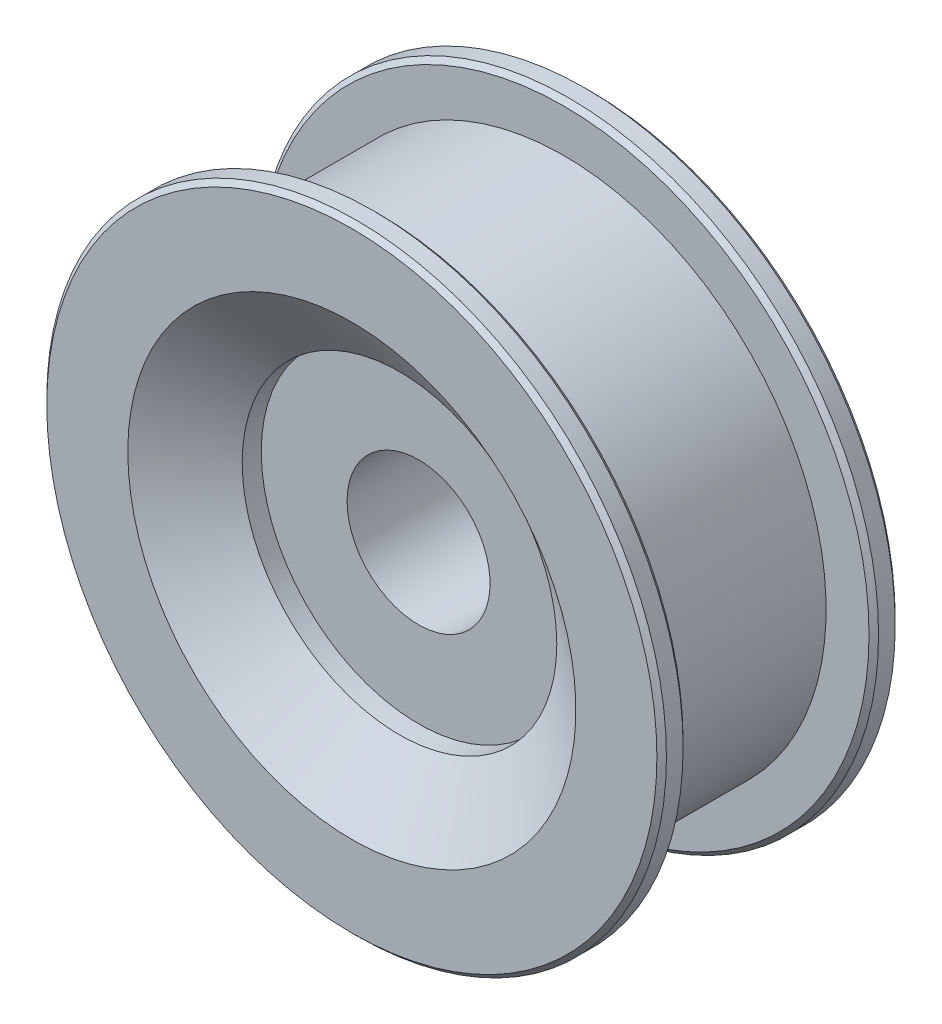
ISO-10303-21;
HEADER;
FILE_DESCRIPTION(('STEP AP214'),'2;1');
FILE_NAME('part.step','',(''),(''),'','','');
FILE_SCHEMA(('AUTOMOTIVE_DESIGN { 1 0 10303 214 1 1 1 1 }'));
ENDSEC;
DATA;
#1=APPLICATION_CONTEXT('core data for automotive mechanical design processes');
#2=APPLICATION_PROTOCOL_DEFINITION('international standard','automotive_design',2000,#1);
#3=PRODUCT_CONTEXT('',#1,'mechanical');
#4=PRODUCT('Part','Part','',(#3));
#5=PRODUCT_RELATED_PRODUCT_CATEGORY('part','',(#4));
#6=PRODUCT_DEFINITION_FORMATION('','',#4);
#7=PRODUCT_DEFINITION_CONTEXT('part definition',#1,'design');
#8=PRODUCT_DEFINITION('design','',#6,#7);
#9=PRODUCT_DEFINITION_SHAPE('','',#8);
#10=(LENGTH_UNIT() NAMED_UNIT(*) SI_UNIT(.MILLI.,.METRE.));
#11=(NAMED_UNIT(*) PLANE_ANGLE_UNIT() SI_UNIT($,.RADIAN.));
#12=(NAMED_UNIT(*) SI_UNIT($,.STERADIAN.) SOLID_ANGLE_UNIT());
#13=UNCERTAINTY_MEASURE_WITH_UNIT(LENGTH_MEASURE(1.E-05),#10,'distance_accuracy_value','');
#14=(GEOMETRIC_REPRESENTATION_CONTEXT(3) GLOBAL_UNCERTAINTY_ASSIGNED_CONTEXT((#13)) GLOBAL_UNIT_ASSIGNED_CONTEXT((#10,
#11,#12)) REPRESENTATION_CONTEXT('',''));
#15=CARTESIAN_POINT('',(0.,0.,0.));
#16=DIRECTION('',(0.,0.,1.));
#17=DIRECTION('',(1.,0.,0.));
#18=AXIS2_PLACEMENT_3D('',#15,#16,#17);
#19=CARTESIAN_POINT('',(0.,7.5,-5.5));
#20=DIRECTION('',(0.,0.,-1.));
#21=DIRECTION('',(-1.,0.,0.));
#22=AXIS2_PLACEMENT_3D('',#19,#20,#21);
#23=PLANE('',#22);
#24=CARTESIAN_POINT('',(0.,0.,-5.5));
#25=DIRECTION('',(0.,0.,-1.));
#26=DIRECTION('',(-1.,0.,0.));
#27=AXIS2_PLACEMENT_3D('',#24,#25,#26);
#28=CIRCLE('',#27,16.5);
#29=CARTESIAN_POINT('',(-16.5,0.,-5.5));
#30=VERTEX_POINT('',#29);
#31=EDGE_CURVE('E71',#30,#30,#28,.T.);
#32=ORIENTED_EDGE('',*,*,#31,.T.);
#33=EDGE_LOOP('',(#32));
#34=FACE_BOUND('',#33,.T.);
#35=CARTESIAN_POINT('',(0.,0.,-5.5));
#36=DIRECTION('',(0.,0.,-1.));
#37=DIRECTION('',(-1.,0.,0.));
#38=AXIS2_PLACEMENT_3D('',#35,#36,#37);
#39=CIRCLE('',#38,7.5);
#40=CARTESIAN_POINT('',(-7.5,0.,-5.5));
#41=VERTEX_POINT('',#40);
#42=EDGE_CURVE('E44',#41,#41,#39,.T.);
#43=ORIENTED_EDGE('',*,*,#42,.F.);
#44=EDGE_LOOP('',(#43));
#45=FACE_BOUND('',#44,.T.);
#46=ADVANCED_FACE('F12',(#34,#45),#23,.T.);
#47=CARTESIAN_POINT('',(0.,0.,-20.));
#48=DIRECTION('',(0.,0.,-1.));
#49=DIRECTION('',(-1.,0.,0.));
#50=AXIS2_PLACEMENT_3D('',#47,#48,#49);
#51=CYLINDRICAL_SURFACE('',#50,7.5);
#52=ORIENTED_EDGE('',*,*,#42,.T.);
#53=EDGE_LOOP('',(#52));
#54=FACE_BOUND('',#53,.T.);
#55=CARTESIAN_POINT('',(0.,0.,5.5));
#56=DIRECTION('',(0.,0.,-1.));
#57=DIRECTION('',(-1.,0.,0.));
#58=AXIS2_PLACEMENT_3D('',#55,#56,#57);
#59=CIRCLE('',#58,7.5);
#60=CARTESIAN_POINT('',(-7.5,0.,5.5));
#61=VERTEX_POINT('',#60);
#62=EDGE_CURVE('E47',#61,#61,#59,.T.);
#63=ORIENTED_EDGE('',*,*,#62,.F.);
#64=EDGE_LOOP('',(#63));
#65=FACE_BOUND('',#64,.T.);
#66=ADVANCED_FACE('F95',(#54,#65),#51,.F.);
#67=CARTESIAN_POINT('',(0.,7.5,5.5));
#68=DIRECTION('',(0.,0.,-1.));
#69=DIRECTION('',(-1.,0.,0.));
#70=AXIS2_PLACEMENT_3D('',#67,#68,#69);
#71=PLANE('',#70);
#72=CARTESIAN_POINT('',(0.,0.,5.5));
#73=DIRECTION('',(0.,0.,-1.));
#74=DIRECTION('',(-1.,0.,0.));
#75=AXIS2_PLACEMENT_3D('',#72,#73,#74);
#76=CIRCLE('',#75,16.5);
#77=CARTESIAN_POINT('',(-16.5,0.,5.5));
#78=VERTEX_POINT('',#77);
#79=EDGE_CURVE('E50',#78,#78,#76,.T.);
#80=ORIENTED_EDGE('',*,*,#79,.F.);
#81=EDGE_LOOP('',(#80));
#82=FACE_BOUND('',#81,.T.);
#83=ORIENTED_EDGE('',*,*,#62,.T.);
#84=EDGE_LOOP('',(#83));
#85=FACE_BOUND('',#84,.T.);
#86=ADVANCED_FACE('F100',(#82,#85),#71,.F.);
#87=CARTESIAN_POINT('',(0.,0.,-20.));
#88=DIRECTION('',(0.,0.,-1.));
#89=DIRECTION('',(-1.,0.,0.));
#90=AXIS2_PLACEMENT_3D('',#87,#88,#89);
#91=CYLINDRICAL_SURFACE('',#90,16.5);
#92=CARTESIAN_POINT('',(0.,0.,7.5));
#93=DIRECTION('',(0.,0.,-1.));
#94=DIRECTION('',(-1.,0.,0.));
#95=AXIS2_PLACEMENT_3D('',#92,#93,#94);
#96=CIRCLE('',#95,16.5);
#97=CARTESIAN_POINT('',(-16.5,0.,7.5));
#98=VERTEX_POINT('',#97);
#99=EDGE_CURVE('E53',#98,#98,#96,.T.);
#100=ORIENTED_EDGE('',*,*,#99,.F.);
#101=EDGE_LOOP('',(#100));
#102=FACE_BOUND('',#101,.T.);
#103=ORIENTED_EDGE('',*,*,#79,.T.);
#104=EDGE_LOOP('',(#103));
#105=FACE_BOUND('',#104,.T.);
#106=ADVANCED_FACE('F137',(#102,#105),#91,.F.);
#107=CARTESIAN_POINT('',(0.,0.,7.5));
#108=DIRECTION('',(0.,0.,1.));
#109=DIRECTION('',(1.,0.,0.));
#110=AXIS2_PLACEMENT_3D('',#107,#108,#109);
#111=CONICAL_SURFACE('',#110,16.5,0.950546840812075);
#112=CARTESIAN_POINT('',(0.,0.,12.5));
#113=DIRECTION('',(0.,0.,-1.));
#114=DIRECTION('',(-1.,0.,0.));
#115=AXIS2_PLACEMENT_3D('',#112,#113,#114);
#116=CIRCLE('',#115,23.5);
#117=CARTESIAN_POINT('',(-23.5,0.,12.5));
#118=VERTEX_POINT('',#117);
#119=EDGE_CURVE('E56',#118,#118,#116,.T.);
#120=ORIENTED_EDGE('',*,*,#119,.F.);
#121=EDGE_LOOP('',(#120));
#122=FACE_BOUND('',#121,.T.);
#123=ORIENTED_EDGE('',*,*,#99,.T.);
#124=EDGE_LOOP('',(#123));
#125=FACE_BOUND('',#124,.T.);
#126=ADVANCED_FACE('F131',(#122,#125),#111,.F.);
#127=CARTESIAN_POINT('',(0.,32.5,12.5));
#128=DIRECTION('',(0.,0.,1.));
#129=DIRECTION('',(1.,0.,0.));
#130=AXIS2_PLACEMENT_3D('',#127,#128,#129);
#131=PLANE('',#130);
#132=CARTESIAN_POINT('',(0.,0.,12.5));
#133=DIRECTION('',(0.,0.,1.));
#134=DIRECTION('',(1.,0.,0.));
#135=AXIS2_PLACEMENT_3D('',#132,#133,#134);
#136=CIRCLE('',#135,32.);
#137=CARTESIAN_POINT('',(32.,0.,12.5));
#138=VERTEX_POINT('',#137);
#139=EDGE_CURVE('E19',#138,#138,#136,.T.);
#140=ORIENTED_EDGE('',*,*,#139,.T.);
#141=EDGE_LOOP('',(#140));
#142=FACE_BOUND('',#141,.T.);
#143=ORIENTED_EDGE('',*,*,#119,.T.);
#144=EDGE_LOOP('',(#143));
#145=FACE_BOUND('',#144,.T.);
#146=ADVANCED_FACE('F121',(#142,#145),#131,.T.);
#147=CARTESIAN_POINT('',(0.,0.,-20.));
#148=DIRECTION('',(0.,0.,-1.));
#149=DIRECTION('',(-1.,0.,0.));
#150=AXIS2_PLACEMENT_3D('',#147,#148,#149);
#151=CYLINDRICAL_SURFACE('',#150,32.5);
#152=CARTESIAN_POINT('',(0.,0.,12.));
#153=DIRECTION('',(0.,0.,1.));
#154=DIRECTION('',(1.,0.,0.));
#155=AXIS2_PLACEMENT_3D('',#152,#153,#154);
#156=CIRCLE('',#155,32.5);
#157=CARTESIAN_POINT('',(32.5,0.,12.));
#158=VERTEX_POINT('',#157);
#159=EDGE_CURVE('E23',#158,#158,#156,.F.);
#160=ORIENTED_EDGE('',*,*,#159,.T.);
#161=EDGE_LOOP('',(#160));
#162=FACE_BOUND('',#161,.T.);
#163=CARTESIAN_POINT('',(0.,0.,10.25));
#164=DIRECTION('',(0.,0.,1.));
#165=DIRECTION('',(1.,0.,0.));
#166=AXIS2_PLACEMENT_3D('',#163,#164,#165);
#167=CIRCLE('',#166,32.5);
#168=CARTESIAN_POINT('',(32.5,0.,10.25));
#169=VERTEX_POINT('',#168);
#170=EDGE_CURVE('E27',#169,#169,#167,.T.);
#171=ORIENTED_EDGE('',*,*,#170,.T.);
#172=EDGE_LOOP('',(#171));
#173=FACE_BOUND('',#172,.T.);
#174=ADVANCED_FACE('F117',(#162,#173),#151,.T.);
#175=CARTESIAN_POINT('',(0.,32.5,9.75));
#176=DIRECTION('',(0.,0.,1.));
#177=DIRECTION('',(1.,0.,0.));
#178=AXIS2_PLACEMENT_3D('',#175,#176,#177);
#179=PLANE('',#178);
#180=CARTESIAN_POINT('',(0.,0.,9.75));
#181=DIRECTION('',(0.,0.,1.));
#182=DIRECTION('',(1.,0.,0.));
#183=AXIS2_PLACEMENT_3D('',#180,#181,#182);
#184=CIRCLE('',#183,32.);
#185=CARTESIAN_POINT('',(32.,0.,9.75));
#186=VERTEX_POINT('',#185);
#187=EDGE_CURVE('E8',#186,#186,#184,.F.);
#188=ORIENTED_EDGE('',*,*,#187,.T.);
#189=EDGE_LOOP('',(#188));
#190=FACE_BOUND('',#189,.T.);
#191=CARTESIAN_POINT('',(0.,0.,9.75));
#192=DIRECTION('',(0.,0.,-1.));
#193=DIRECTION('',(-1.,0.,0.));
#194=AXIS2_PLACEMENT_3D('',#191,#192,#193);
#195=CIRCLE('',#194,27.5);
#196=CARTESIAN_POINT('',(-27.5,0.,9.75));
#197=VERTEX_POINT('',#196);
#198=EDGE_CURVE('E59',#197,#197,#195,.T.);
#199=ORIENTED_EDGE('',*,*,#198,.F.);
#200=EDGE_LOOP('',(#199));
#201=FACE_BOUND('',#200,.T.);
#202=ADVANCED_FACE('F120',(#190,#201),#179,.F.);
#203=CARTESIAN_POINT('',(0.,0.,-20.));
#204=DIRECTION('',(0.,0.,-1.));
#205=DIRECTION('',(-1.,0.,0.));
#206=AXIS2_PLACEMENT_3D('',#203,#204,#205);
#207=CYLINDRICAL_SURFACE('',#206,27.5);
#208=ORIENTED_EDGE('',*,*,#198,.T.);
#209=EDGE_LOOP('',(#208));
#210=FACE_BOUND('',#209,.T.);
#211=CARTESIAN_POINT('',(0.,0.,-9.75));
#212=DIRECTION('',(0.,0.,-1.));
#213=DIRECTION('',(-1.,0.,0.));
#214=AXIS2_PLACEMENT_3D('',#211,#212,#213);
#215=CIRCLE('',#214,27.5);
#216=CARTESIAN_POINT('',(-27.5,0.,-9.75));
#217=VERTEX_POINT('',#216);
#218=EDGE_CURVE('E62',#217,#217,#215,.T.);
#219=ORIENTED_EDGE('',*,*,#218,.F.);
#220=EDGE_LOOP('',(#219));
#221=FACE_BOUND('',#220,.T.);
#222=ADVANCED_FACE('F129',(#210,#221),#207,.T.);
#223=CARTESIAN_POINT('',(0.,32.5,-9.75));
#224=DIRECTION('',(0.,0.,1.));
#225=DIRECTION('',(1.,0.,0.));
#226=AXIS2_PLACEMENT_3D('',#223,#224,#225);
#227=PLANE('',#226);
#228=CARTESIAN_POINT('',(0.,0.,-9.75));
#229=DIRECTION('',(0.,0.,1.));
#230=DIRECTION('',(1.,0.,0.));
#231=AXIS2_PLACEMENT_3D('',#228,#229,#230);
#232=CIRCLE('',#231,32.);
#233=CARTESIAN_POINT('',(32.,0.,-9.75));
#234=VERTEX_POINT('',#233);
#235=EDGE_CURVE('E32',#234,#234,#232,.T.);
#236=ORIENTED_EDGE('',*,*,#235,.T.);
#237=EDGE_LOOP('',(#236));
#238=FACE_BOUND('',#237,.T.);
#239=ORIENTED_EDGE('',*,*,#218,.T.);
#240=EDGE_LOOP('',(#239));
#241=FACE_BOUND('',#240,.T.);
#242=ADVANCED_FACE('F193',(#238,#241),#227,.T.);
#243=CARTESIAN_POINT('',(0.,0.,-20.));
#244=DIRECTION('',(0.,0.,-1.));
#245=DIRECTION('',(-1.,0.,0.));
#246=AXIS2_PLACEMENT_3D('',#243,#244,#245);
#247=CYLINDRICAL_SURFACE('',#246,32.5);
#248=CARTESIAN_POINT('',(0.,0.,-12.));
#249=DIRECTION('',(0.,0.,1.));
#250=DIRECTION('',(1.,0.,0.));
#251=AXIS2_PLACEMENT_3D('',#248,#249,#250);
#252=CIRCLE('',#251,32.5);
#253=CARTESIAN_POINT('',(32.5,0.,-12.));
#254=VERTEX_POINT('',#253);
#255=EDGE_CURVE('E35',#254,#254,#252,.T.);
#256=ORIENTED_EDGE('',*,*,#255,.T.);
#257=EDGE_LOOP('',(#256));
#258=FACE_BOUND('',#257,.T.);
#259=CARTESIAN_POINT('',(0.,0.,-10.25));
#260=DIRECTION('',(0.,0.,1.));
#261=DIRECTION('',(1.,0.,0.));
#262=AXIS2_PLACEMENT_3D('',#259,#260,#261);
#263=CIRCLE('',#262,32.5);
#264=CARTESIAN_POINT('',(32.5,0.,-10.25));
#265=VERTEX_POINT('',#264);
#266=EDGE_CURVE('E38',#265,#265,#263,.F.);
#267=ORIENTED_EDGE('',*,*,#266,.T.);
#268=EDGE_LOOP('',(#267));
#269=FACE_BOUND('',#268,.T.);
#270=ADVANCED_FACE('F202',(#258,#269),#247,.T.);
#271=CARTESIAN_POINT('',(0.,32.5,-12.5));
#272=DIRECTION('',(0.,0.,1.));
#273=DIRECTION('',(1.,0.,0.));
#274=AXIS2_PLACEMENT_3D('',#271,#272,#273);
#275=PLANE('',#274);
#276=CARTESIAN_POINT('',(0.,0.,-12.5));
#277=DIRECTION('',(0.,0.,1.));
#278=DIRECTION('',(1.,0.,0.));
#279=AXIS2_PLACEMENT_3D('',#276,#277,#278);
#280=CIRCLE('',#279,32.);
#281=CARTESIAN_POINT('',(32.,0.,-12.5));
#282=VERTEX_POINT('',#281);
#283=EDGE_CURVE('E41',#282,#282,#280,.F.);
#284=ORIENTED_EDGE('',*,*,#283,.T.);
#285=EDGE_LOOP('',(#284));
#286=FACE_BOUND('',#285,.T.);
#287=CARTESIAN_POINT('',(0.,0.,-12.5));
#288=DIRECTION('',(0.,0.,-1.));
#289=DIRECTION('',(-1.,0.,0.));
#290=AXIS2_PLACEMENT_3D('',#287,#288,#289);
#291=CIRCLE('',#290,23.5);
#292=CARTESIAN_POINT('',(-23.5,0.,-12.5));
#293=VERTEX_POINT('',#292);
#294=EDGE_CURVE('E65',#293,#293,#291,.T.);
#295=ORIENTED_EDGE('',*,*,#294,.F.);
#296=EDGE_LOOP('',(#295));
#297=FACE_BOUND('',#296,.T.);
#298=ADVANCED_FACE('F91',(#286,#297),#275,.F.);
#299=CARTESIAN_POINT('',(0.,0.,-7.5));
#300=DIRECTION('',(0.,0.,-1.));
#301=DIRECTION('',(-1.,0.,0.));
#302=AXIS2_PLACEMENT_3D('',#299,#300,#301);
#303=CONICAL_SURFACE('',#302,16.5,0.950546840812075);
#304=ORIENTED_EDGE('',*,*,#294,.T.);
#305=EDGE_LOOP('',(#304));
#306=FACE_BOUND('',#305,.T.);
#307=CARTESIAN_POINT('',(0.,0.,-7.5));
#308=DIRECTION('',(0.,0.,-1.));
#309=DIRECTION('',(-1.,0.,0.));
#310=AXIS2_PLACEMENT_3D('',#307,#308,#309);
#311=CIRCLE('',#310,16.5);
#312=CARTESIAN_POINT('',(-16.5,0.,-7.5));
#313=VERTEX_POINT('',#312);
#314=EDGE_CURVE('E68',#313,#313,#311,.T.);
#315=ORIENTED_EDGE('',*,*,#314,.F.);
#316=EDGE_LOOP('',(#315));
#317=FACE_BOUND('',#316,.T.);
#318=ADVANCED_FACE('F80',(#306,#317),#303,.F.);
#319=CARTESIAN_POINT('',(0.,0.,-20.));
#320=DIRECTION('',(0.,0.,-1.));
#321=DIRECTION('',(-1.,0.,0.));
#322=AXIS2_PLACEMENT_3D('',#319,#320,#321);
#323=CYLINDRICAL_SURFACE('',#322,16.5);
#324=ORIENTED_EDGE('',*,*,#314,.T.);
#325=EDGE_LOOP('',(#324));
#326=FACE_BOUND('',#325,.T.);
#327=ORIENTED_EDGE('',*,*,#31,.F.);
#328=EDGE_LOOP('',(#327));
#329=FACE_BOUND('',#328,.T.);
#330=ADVANCED_FACE('F77',(#326,#329),#323,.F.);
#331=CARTESIAN_POINT('',(0.,0.,-12.5));
#332=DIRECTION('',(0.,0.,1.));
#333=DIRECTION('',(1.,0.,0.));
#334=AXIS2_PLACEMENT_3D('',#331,#332,#333);
#335=CONICAL_SURFACE('',#334,32.,0.785398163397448);
#336=ORIENTED_EDGE('',*,*,#255,.F.);
#337=EDGE_LOOP('',(#336));
#338=FACE_BOUND('',#337,.T.);
#339=ORIENTED_EDGE('',*,*,#283,.F.);
#340=EDGE_LOOP('',(#339));
#341=FACE_BOUND('',#340,.T.);
#342=ADVANCED_FACE('F79',(#338,#341),#335,.T.);
#343=CARTESIAN_POINT('',(0.,0.,-10.25));
#344=DIRECTION('',(0.,0.,-1.));
#345=DIRECTION('',(-1.,0.,0.));
#346=AXIS2_PLACEMENT_3D('',#343,#344,#345);
#347=CONICAL_SURFACE('',#346,32.5,0.785398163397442);
#348=ORIENTED_EDGE('',*,*,#235,.F.);
#349=EDGE_LOOP('',(#348));
#350=FACE_BOUND('',#349,.T.);
#351=ORIENTED_EDGE('',*,*,#266,.F.);
#352=EDGE_LOOP('',(#351));
#353=FACE_BOUND('',#352,.T.);
#354=ADVANCED_FACE('F88',(#350,#353),#347,.T.);
#355=CARTESIAN_POINT('',(0.,0.,12.));
#356=DIRECTION('',(0.,0.,-1.));
#357=DIRECTION('',(-1.,0.,0.));
#358=AXIS2_PLACEMENT_3D('',#355,#356,#357);
#359=CONICAL_SURFACE('',#358,32.5,0.785398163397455);
#360=ORIENTED_EDGE('',*,*,#139,.F.);
#361=EDGE_LOOP('',(#360));
#362=FACE_BOUND('',#361,.T.);
#363=ORIENTED_EDGE('',*,*,#159,.F.);
#364=EDGE_LOOP('',(#363));
#365=FACE_BOUND('',#364,.T.);
#366=ADVANCED_FACE('F106',(#362,#365),#359,.T.);
#367=CARTESIAN_POINT('',(0.,0.,9.75));
#368=DIRECTION('',(0.,0.,1.));
#369=DIRECTION('',(1.,0.,0.));
#370=AXIS2_PLACEMENT_3D('',#367,#368,#369);
#371=CONICAL_SURFACE('',#370,32.,0.785398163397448);
#372=ORIENTED_EDGE('',*,*,#170,.F.);
#373=EDGE_LOOP('',(#372));
#374=FACE_BOUND('',#373,.T.);
#375=ORIENTED_EDGE('',*,*,#187,.F.);
#376=EDGE_LOOP('',(#375));
#377=FACE_BOUND('',#376,.T.);
#378=ADVANCED_FACE('F14',(#374,#377),#371,.T.);
#379=CLOSED_SHELL('',(#46,#66,#86,#106,#126,#146,#174,#202,#222,#242,#270,#298,#318,#330,#342,
#354,#366,#378));
#380=MANIFOLD_SOLID_BREP('B1',#379);
#381=ADVANCED_BREP_SHAPE_REPRESENTATION('',(#18,#380),#14);
#382=SHAPE_DEFINITION_REPRESENTATION(#9,#381);
ENDSEC;
END-ISO-10303-21;
